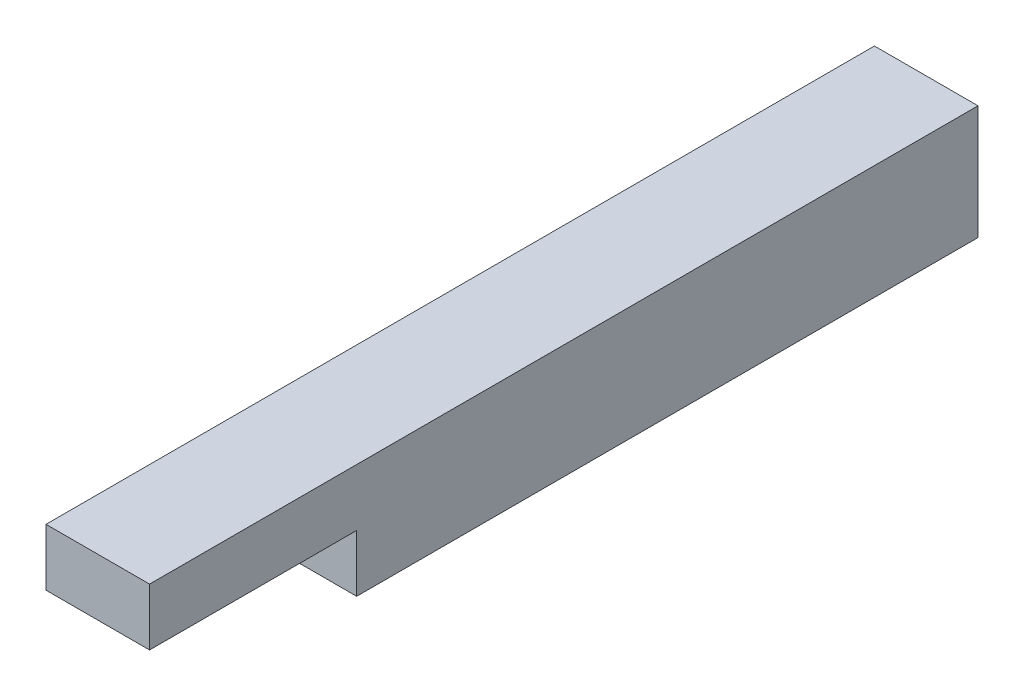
from build123d import *

# Parameters (mm, degrees)
BOSS_EXTRUDE1_DEPTH = 6.35


with BuildPart() as part:
    # Sketch1 → Boss-Extrude1 (new body)
    with BuildSketch(Plane(origin=(0, 0, 0), x_dir=(0, 0, -1), z_dir=(1, 0, 0))):
        Polygon((-50.8, 7), (0, 7), (0, 0), (-38.1, 0), (-38.1, 3.5), (-50.8, 3.5), align=None)
    extrude(amount=BOSS_EXTRUDE1_DEPTH)


solid = part.part
